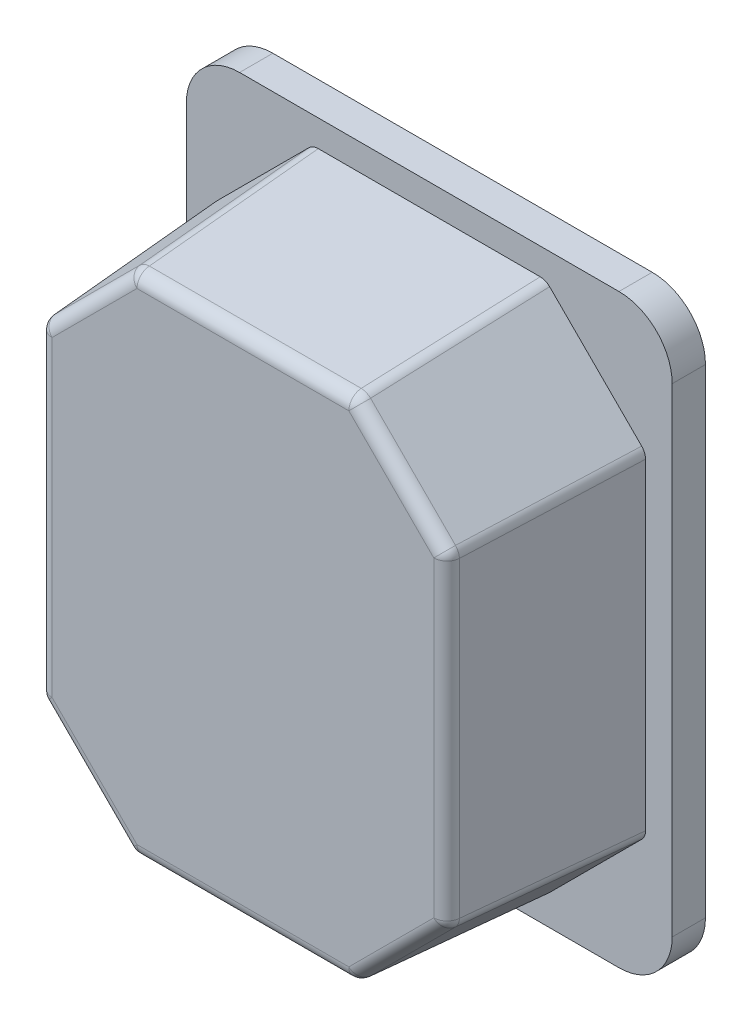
from build123d import *

# Parameters (mm, degrees)
BASE_EXTRUSION_DEPTH = 5
BOSS_EXTRU_1_DEPTH   = 28
BOSS_EXTRU_1_TAPER   = 4
CONG_2MM_R           = 2
COQUE1_T             = -1.5


with BuildPart() as part:
    # Esquisse1 → Base-Extrusion (new body)
    with BuildSketch(Plane.XY):
        with BuildLine():
            Line((-28.5, 44), (28.5, 44))
            ThreePointArc((28.5, 44), (34.156854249, 41.656854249), (36.5, 36))
            Line((36.5, 36), (36.5, -36))
            ThreePointArc((36.5, -36), (34.156854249, -41.656854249), (28.5, -44))
            Line((28.5, -44), (-28.5, -44))
            ThreePointArc((-28.5, -44), (-34.156854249, -41.656854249), (-36.5, -36))
            Line((-36.5, -36), (-36.5, 36))
            ThreePointArc((-36.5, 36), (-34.156854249, 41.656854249), (-28.5, 44))
        make_face()
    extrude(amount=BASE_EXTRUSION_DEPTH)

    # Esquisse2 → Boss.-Extru.1 (add)
    with BuildSketch(Plane.XY.offset(5)):
        Polygon((-17.5, 40), (-32.5, 25), (-32.5, -25), (-17.5, -40), (17.5, -40), (32.5, -25), (32.5, 25), (17.5, 40), align=None)
    extrude(amount=BOSS_EXTRU_1_DEPTH, taper=BOSS_EXTRU_1_TAPER)

    # Cong_-2mm
    cong_2mm_edges = [part.edges().sort_by_distance(p)[0] for p in [
        (17.094495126, 39.021024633, 19),
        (-17.094495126, 39.021024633, 19),
        (0, 38.042049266, 33),
        (31.521024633, 24.594495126, 19),
        (23.615519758, 31.115519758, 33),
        (31.521024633, -24.594495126, 19),
        (30.542049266, 0, 33),
        (17.094495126, -39.021024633, 19),
        (23.615519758, -31.115519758, 33),
        (-17.094495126, -39.021024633, 19),
        (0, -38.042049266, 33),
        (-31.521024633, -24.594495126, 19),
        (-23.615519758, -31.115519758, 33),
        (-31.521024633, 24.594495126, 19),
        (-30.542049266, 0, 33),
        (-23.615519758, 31.115519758, 33),
    ]]
    fillet(cong_2mm_edges, radius=CONG_2MM_R)

    # Coque1
    coque1_openings = [part.faces().sort_by_distance(p)[0] for p in [
        (0, 0, 0),
    ]]
    offset(amount=COQUE1_T, openings=coque1_openings, kind=Kind.INTERSECTION)


solid = part.part
